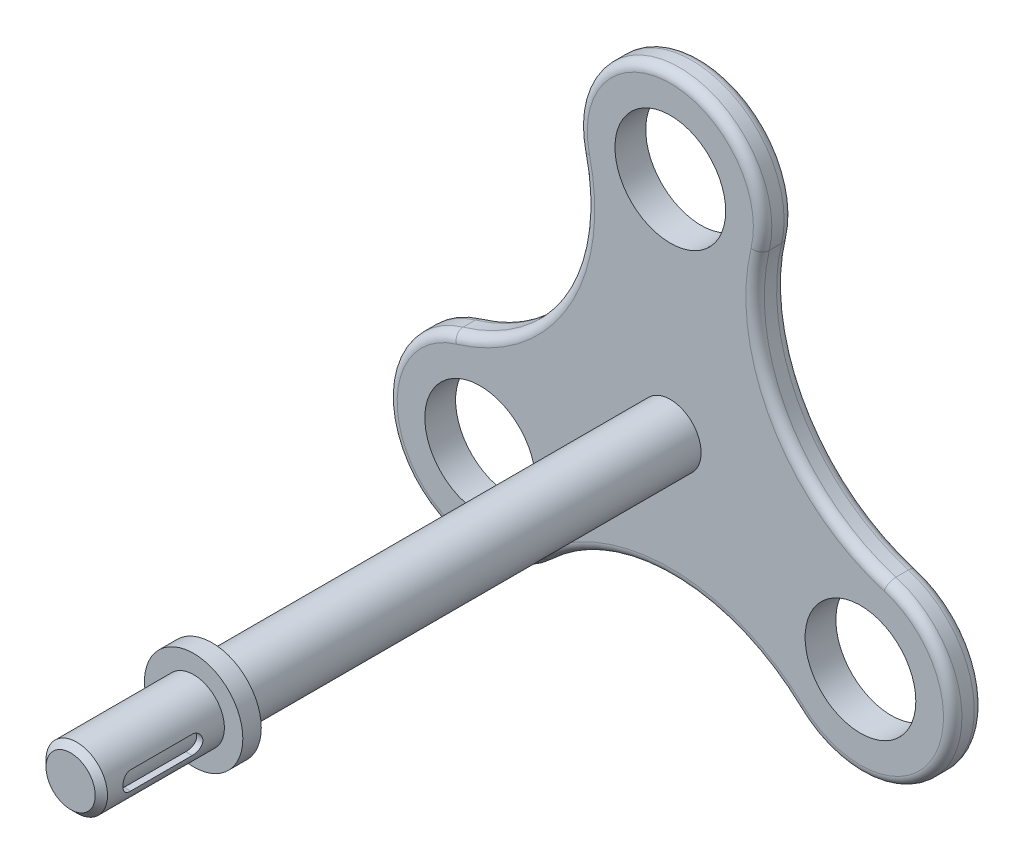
from build123d import *

# Parameters (mm, degrees)
SKETCH2_R               = 4.5
BOSS_EXTRUDE1_DEPTH     = 1.25
SKETCH2_4_R             = 2.5
BOSS_EXTRUDE2_DEPTH     = 50
FILLET1_R               = 0.75
SKETCH3_W               = 1.5
SKETCH3_H               = 1.5
CHAMFER1_SIZE           = 0.5
CUT_EXTRUDE1_REACH      = 67.64
CUT_EXTRUDE1_END_RADIUS = 2
CUT_EXTRUDE1_START      = 5


with BuildPart() as part:
    # Sketch2 → Boss-Extrude1 (new, symmetric)
    with BuildSketch(Plane.XY):
        with BuildLine():
            ThreePointArc((-17.600056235, -1.58323722), (-8.898256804, 5.290630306), (-7.29621262, 16.263543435))
            ThreePointArc((-7.29621262, 16.263543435), (0, 25.5), (7.29621262, 16.263543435))
            ThreePointArc((7.29621262, 16.263543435), (8.898256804, 5.290630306), (17.600056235, -1.58323722))
            ThreePointArc((17.600056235, -1.58323722), (21.950955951, -12.520170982), (10.303843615, -14.220648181))
            ThreePointArc((10.303843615, -14.220648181), (0, -10.121602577), (-10.303843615, -14.220648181))
            ThreePointArc((-10.303843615, -14.220648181), (-21.950955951, -12.520170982), (-17.600056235, -1.58323722))
        make_face()
        with Locations((0, 18)):
            Circle(SKETCH2_R, mode=Mode.SUBTRACT)
        with Locations((15.455765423, -8.770170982)):
            Circle(SKETCH2_R, mode=Mode.SUBTRACT)
        with Locations((-15.455765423, -8.770170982)):
            Circle(SKETCH2_R, mode=Mode.SUBTRACT)
    extrude(amount=BOSS_EXTRUDE1_DEPTH, both=True)

    # Sketch2_4 → Boss-Extrude2 (add)
    with BuildSketch(Plane.XY):
        Circle(SKETCH2_4_R)
    extrude(amount=BOSS_EXTRUDE2_DEPTH)

    # Fillet1
    fillet1_edges = [part.edges().sort_by_distance(p)[0] for p in [
        (-21.950955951, -12.520170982, -1.25),
        (-8.898256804, 5.290630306, -1.25),
        (0, 25.5, -1.25),
        (8.898256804, 5.290630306, -1.25),
        (21.950955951, -12.520170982, -1.25),
        (0, -10.121602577, -1.25),
        (0, -10.121602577, 1.25),
        (21.950955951, -12.520170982, 1.25),
        (8.898256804, 5.290630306, 1.25),
        (0, 25.5, 1.25),
        (-8.898256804, 5.290630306, 1.25),
        (-21.950955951, -12.520170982, 1.25),
    ]]
    fillet(fillet1_edges, radius=FILLET1_R)

    # Sketch3 → Revolve1 (revolve)
    with BuildSketch(Plane(origin=(0, 0, 0), x_dir=(0, 0, -1), z_dir=(1, 0, 0)), mode=Mode.PRIVATE) as revolve1_sk:
        with Locations((-39.25, 3.25)):
            Rectangle(SKETCH3_W, SKETCH3_H)
    revolve(revolve1_sk.sketch.rotate(Axis((0, 0, 50), (0, 0, -1)), 90), axis=Axis((0, 0, 50), (0, 0, -1)))

    # Chamfer1
    chamfer1_edges = [part.edges().sort_by_distance(p)[0] for p in [
        (-2.5, 0, 50),
    ]]
    chamfer(chamfer1_edges, length=CHAMFER1_SIZE)

    # Cut-Extrude1: up to this cylinder (the profile starts outside it)
    cut_extrude1_end = Plane(origin=(0, 0, 45), z_dir=(0, 0, -1)) * Cylinder(CUT_EXTRUDE1_END_RADIUS, 140.28, mode=Mode.PRIVATE)
    # Sketch4 → Cut-Extrude1 (cut, up to the surface)
    with BuildSketch(Plane(origin=(0, 0, 0), x_dir=(0, 0, -1), z_dir=(1, 0, 0)).offset(CUT_EXTRUDE1_START), mode=Mode.PRIVATE) as cut_extrude1_sk1:
        with BuildLine():
            Line((-47.5, 0.75), (-42.5, 0.75))
            ThreePointArc((-42.5, 0.75), (-41.75, 0), (-42.5, -0.75))
            Line((-42.5, -0.75), (-47.5, -0.75))
            ThreePointArc((-47.5, -0.75), (-48.25, 0), (-47.5, 0.75))
        make_face()
    cut_extrude1_tool1 = extrude(cut_extrude1_sk1.sketch, amount=-CUT_EXTRUDE1_REACH, mode=Mode.PRIVATE) - cut_extrude1_end
    add(cut_extrude1_tool1.solids().sort_by_distance((5, 0, 45))[0], mode=Mode.SUBTRACT)


solid = part.part
